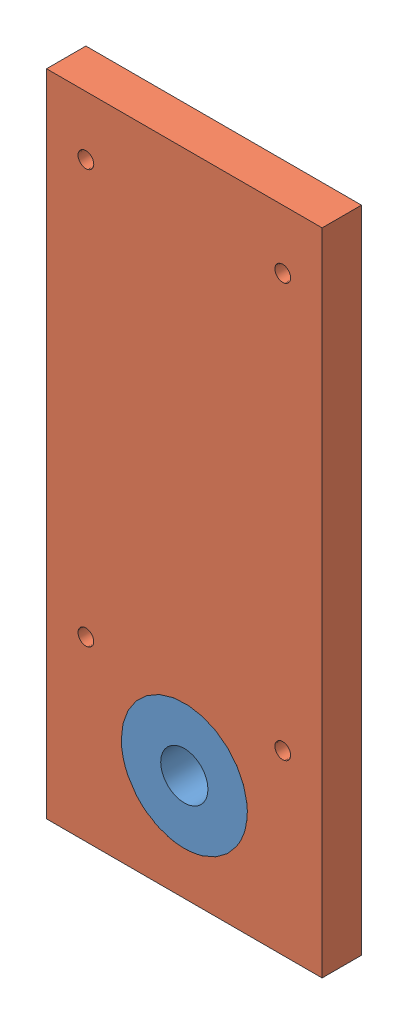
SolidWorks assembly Z-rodamiento con soporte.SLDASM, configuration Predeterminado (file format 3800). Lengths in mm.
Overall size (70 165 10).
2 component instances, 2 part files, 0 mates.
Components (placement in the parent):
- Z-rodamiento (7201.2RS.TVP)-1: Z-rodamiento (7201.2RS.TVP).SLDPRT [Predeterminado] at origin size (32 32 10)
- Z-Soporte rodamiento-1: Z-Soporte rodamiento.SLDPRT [Predeterminado] at origin size (70 165 10)
